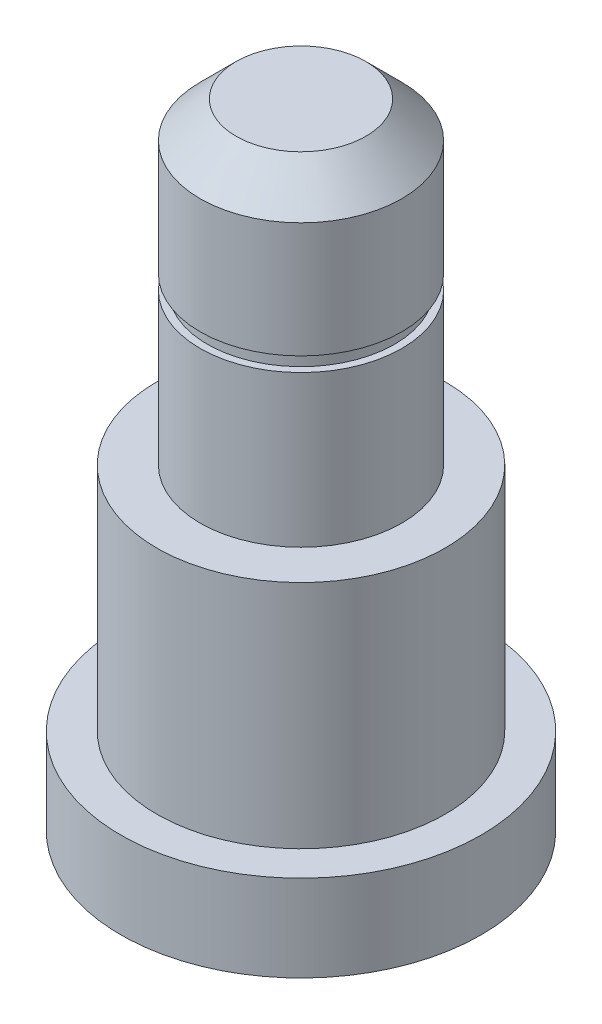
ISO-10303-21;
HEADER;
FILE_DESCRIPTION(('STEP AP214'),'2;1');
FILE_NAME('part.step','',(''),(''),'','','');
FILE_SCHEMA(('AUTOMOTIVE_DESIGN { 1 0 10303 214 1 1 1 1 }'));
ENDSEC;
DATA;
#1=APPLICATION_CONTEXT('core data for automotive mechanical design processes');
#2=APPLICATION_PROTOCOL_DEFINITION('international standard','automotive_design',2000,#1);
#3=PRODUCT_CONTEXT('',#1,'mechanical');
#4=PRODUCT('Part','Part','',(#3));
#5=PRODUCT_RELATED_PRODUCT_CATEGORY('part','',(#4));
#6=PRODUCT_DEFINITION_FORMATION('','',#4);
#7=PRODUCT_DEFINITION_CONTEXT('part definition',#1,'design');
#8=PRODUCT_DEFINITION('design','',#6,#7);
#9=PRODUCT_DEFINITION_SHAPE('','',#8);
#10=(LENGTH_UNIT() NAMED_UNIT(*) SI_UNIT(.MILLI.,.METRE.));
#11=(NAMED_UNIT(*) PLANE_ANGLE_UNIT() SI_UNIT($,.RADIAN.));
#12=(NAMED_UNIT(*) SI_UNIT($,.STERADIAN.) SOLID_ANGLE_UNIT());
#13=UNCERTAINTY_MEASURE_WITH_UNIT(LENGTH_MEASURE(1.E-05),#10,'distance_accuracy_value','');
#14=(GEOMETRIC_REPRESENTATION_CONTEXT(3) GLOBAL_UNCERTAINTY_ASSIGNED_CONTEXT((#13)) GLOBAL_UNIT_ASSIGNED_CONTEXT((#10,
#11,#12)) REPRESENTATION_CONTEXT('',''));
#15=CARTESIAN_POINT('',(0.,0.,0.));
#16=DIRECTION('',(0.,0.,1.));
#17=DIRECTION('',(1.,0.,0.));
#18=AXIS2_PLACEMENT_3D('',#15,#16,#17);
#19=CARTESIAN_POINT('',(0.,0.,0.));
#20=DIRECTION('',(0.,1.,0.));
#21=DIRECTION('',(-1.,0.,0.));
#22=AXIS2_PLACEMENT_3D('',#19,#20,#21);
#23=PLANE('',#22);
#24=CARTESIAN_POINT('',(0.,0.,0.));
#25=DIRECTION('',(0.,1.,0.));
#26=DIRECTION('',(-1.,0.,0.));
#27=AXIS2_PLACEMENT_3D('',#24,#25,#26);
#28=CIRCLE('',#27,12.5);
#29=CARTESIAN_POINT('',(-12.5,0.,0.));
#30=VERTEX_POINT('',#29);
#31=EDGE_CURVE('E10',#30,#30,#28,.T.);
#32=ORIENTED_EDGE('',*,*,#31,.F.);
#33=EDGE_LOOP('',(#32));
#34=FACE_BOUND('',#33,.T.);
#35=ADVANCED_FACE('F29',(#34),#23,.F.);
#36=CARTESIAN_POINT('',(0.,44.,0.));
#37=DIRECTION('',(0.,1.,0.));
#38=DIRECTION('',(-1.,0.,0.));
#39=AXIS2_PLACEMENT_3D('',#36,#37,#38);
#40=CYLINDRICAL_SURFACE('',#39,12.5);
#41=CARTESIAN_POINT('',(0.,6.,0.));
#42=DIRECTION('',(0.,1.,0.));
#43=DIRECTION('',(-1.,0.,0.));
#44=AXIS2_PLACEMENT_3D('',#41,#42,#43);
#45=CIRCLE('',#44,12.5);
#46=CARTESIAN_POINT('',(-12.5,6.,0.));
#47=VERTEX_POINT('',#46);
#48=EDGE_CURVE('E35',#47,#47,#45,.T.);
#49=ORIENTED_EDGE('',*,*,#48,.F.);
#50=EDGE_LOOP('',(#49));
#51=FACE_BOUND('',#50,.T.);
#52=ORIENTED_EDGE('',*,*,#31,.T.);
#53=EDGE_LOOP('',(#52));
#54=FACE_BOUND('',#53,.T.);
#55=ADVANCED_FACE('F122',(#51,#54),#40,.T.);
#56=CARTESIAN_POINT('',(12.5,6.,0.));
#57=DIRECTION('',(0.,-1.,0.));
#58=DIRECTION('',(1.,0.,0.));
#59=AXIS2_PLACEMENT_3D('',#56,#57,#58);
#60=PLANE('',#59);
#61=CARTESIAN_POINT('',(0.,6.,0.));
#62=DIRECTION('',(0.,1.,0.));
#63=DIRECTION('',(-1.,0.,0.));
#64=AXIS2_PLACEMENT_3D('',#61,#62,#63);
#65=CIRCLE('',#64,10.);
#66=CARTESIAN_POINT('',(-10.,6.,0.));
#67=VERTEX_POINT('',#66);
#68=EDGE_CURVE('E39',#67,#67,#65,.T.);
#69=ORIENTED_EDGE('',*,*,#68,.F.);
#70=EDGE_LOOP('',(#69));
#71=FACE_BOUND('',#70,.T.);
#72=ORIENTED_EDGE('',*,*,#48,.T.);
#73=EDGE_LOOP('',(#72));
#74=FACE_BOUND('',#73,.T.);
#75=ADVANCED_FACE('F117',(#71,#74),#60,.F.);
#76=CARTESIAN_POINT('',(0.,44.,0.));
#77=DIRECTION('',(0.,1.,0.));
#78=DIRECTION('',(-1.,0.,0.));
#79=AXIS2_PLACEMENT_3D('',#76,#77,#78);
#80=CYLINDRICAL_SURFACE('',#79,10.);
#81=CARTESIAN_POINT('',(0.,22.,0.));
#82=DIRECTION('',(0.,1.,0.));
#83=DIRECTION('',(-1.,0.,0.));
#84=AXIS2_PLACEMENT_3D('',#81,#82,#83);
#85=CIRCLE('',#84,10.);
#86=CARTESIAN_POINT('',(-10.,22.,0.));
#87=VERTEX_POINT('',#86);
#88=EDGE_CURVE('E43',#87,#87,#85,.T.);
#89=ORIENTED_EDGE('',*,*,#88,.F.);
#90=EDGE_LOOP('',(#89));
#91=FACE_BOUND('',#90,.T.);
#92=ORIENTED_EDGE('',*,*,#68,.T.);
#93=EDGE_LOOP('',(#92));
#94=FACE_BOUND('',#93,.T.);
#95=ADVANCED_FACE('F111',(#91,#94),#80,.T.);
#96=CARTESIAN_POINT('',(10.,22.,0.));
#97=DIRECTION('',(0.,-1.,0.));
#98=DIRECTION('',(1.,0.,0.));
#99=AXIS2_PLACEMENT_3D('',#96,#97,#98);
#100=PLANE('',#99);
#101=CARTESIAN_POINT('',(0.,22.,0.));
#102=DIRECTION('',(0.,1.,0.));
#103=DIRECTION('',(-1.,0.,0.));
#104=AXIS2_PLACEMENT_3D('',#101,#102,#103);
#105=CIRCLE('',#104,7.);
#106=CARTESIAN_POINT('',(-7.,22.,0.));
#107=VERTEX_POINT('',#106);
#108=EDGE_CURVE('E48',#107,#107,#105,.T.);
#109=ORIENTED_EDGE('',*,*,#108,.F.);
#110=EDGE_LOOP('',(#109));
#111=FACE_BOUND('',#110,.T.);
#112=ORIENTED_EDGE('',*,*,#88,.T.);
#113=EDGE_LOOP('',(#112));
#114=FACE_BOUND('',#113,.T.);
#115=ADVANCED_FACE('F105',(#111,#114),#100,.F.);
#116=CARTESIAN_POINT('',(0.,44.,0.));
#117=DIRECTION('',(0.,1.,0.));
#118=DIRECTION('',(-1.,0.,0.));
#119=AXIS2_PLACEMENT_3D('',#116,#117,#118);
#120=CYLINDRICAL_SURFACE('',#119,7.);
#121=CARTESIAN_POINT('',(0.,32.5,0.));
#122=DIRECTION('',(0.,1.,0.));
#123=DIRECTION('',(-1.,0.,0.));
#124=AXIS2_PLACEMENT_3D('',#121,#122,#123);
#125=CIRCLE('',#124,7.);
#126=CARTESIAN_POINT('',(-7.,32.5,0.));
#127=VERTEX_POINT('',#126);
#128=EDGE_CURVE('E51',#127,#127,#125,.T.);
#129=ORIENTED_EDGE('',*,*,#128,.F.);
#130=EDGE_LOOP('',(#129));
#131=FACE_BOUND('',#130,.T.);
#132=ORIENTED_EDGE('',*,*,#108,.T.);
#133=EDGE_LOOP('',(#132));
#134=FACE_BOUND('',#133,.T.);
#135=ADVANCED_FACE('F99',(#131,#134),#120,.T.);
#136=CARTESIAN_POINT('',(7.,32.5,0.));
#137=DIRECTION('',(0.,-1.,0.));
#138=DIRECTION('',(1.,0.,0.));
#139=AXIS2_PLACEMENT_3D('',#136,#137,#138);
#140=PLANE('',#139);
#141=CARTESIAN_POINT('',(0.,32.5,0.));
#142=DIRECTION('',(0.,1.,0.));
#143=DIRECTION('',(-1.,0.,0.));
#144=AXIS2_PLACEMENT_3D('',#141,#142,#143);
#145=CIRCLE('',#144,6.5);
#146=CARTESIAN_POINT('',(-6.5,32.5,0.));
#147=VERTEX_POINT('',#146);
#148=EDGE_CURVE('E54',#147,#147,#145,.T.);
#149=ORIENTED_EDGE('',*,*,#148,.F.);
#150=EDGE_LOOP('',(#149));
#151=FACE_BOUND('',#150,.T.);
#152=ORIENTED_EDGE('',*,*,#128,.T.);
#153=EDGE_LOOP('',(#152));
#154=FACE_BOUND('',#153,.T.);
#155=ADVANCED_FACE('F93',(#151,#154),#140,.F.);
#156=CARTESIAN_POINT('',(0.,44.,0.));
#157=DIRECTION('',(0.,1.,0.));
#158=DIRECTION('',(-1.,0.,0.));
#159=AXIS2_PLACEMENT_3D('',#156,#157,#158);
#160=CYLINDRICAL_SURFACE('',#159,6.5);
#161=CARTESIAN_POINT('',(0.,33.5,0.));
#162=DIRECTION('',(0.,1.,0.));
#163=DIRECTION('',(-1.,0.,0.));
#164=AXIS2_PLACEMENT_3D('',#161,#162,#163);
#165=CIRCLE('',#164,6.5);
#166=CARTESIAN_POINT('',(-6.5,33.5,0.));
#167=VERTEX_POINT('',#166);
#168=EDGE_CURVE('E57',#167,#167,#165,.T.);
#169=ORIENTED_EDGE('',*,*,#168,.F.);
#170=EDGE_LOOP('',(#169));
#171=FACE_BOUND('',#170,.T.);
#172=ORIENTED_EDGE('',*,*,#148,.T.);
#173=EDGE_LOOP('',(#172));
#174=FACE_BOUND('',#173,.T.);
#175=ADVANCED_FACE('F87',(#171,#174),#160,.T.);
#176=CARTESIAN_POINT('',(6.5,33.5,0.));
#177=DIRECTION('',(0.,1.,0.));
#178=DIRECTION('',(-1.,0.,0.));
#179=AXIS2_PLACEMENT_3D('',#176,#177,#178);
#180=PLANE('',#179);
#181=CARTESIAN_POINT('',(0.,33.5,0.));
#182=DIRECTION('',(0.,1.,0.));
#183=DIRECTION('',(-1.,0.,0.));
#184=AXIS2_PLACEMENT_3D('',#181,#182,#183);
#185=CIRCLE('',#184,7.);
#186=CARTESIAN_POINT('',(-7.,33.5,0.));
#187=VERTEX_POINT('',#186);
#188=EDGE_CURVE('E60',#187,#187,#185,.T.);
#189=ORIENTED_EDGE('',*,*,#188,.F.);
#190=EDGE_LOOP('',(#189));
#191=FACE_BOUND('',#190,.T.);
#192=ORIENTED_EDGE('',*,*,#168,.T.);
#193=EDGE_LOOP('',(#192));
#194=FACE_BOUND('',#193,.T.);
#195=ADVANCED_FACE('F81',(#191,#194),#180,.F.);
#196=CARTESIAN_POINT('',(0.,44.,0.));
#197=DIRECTION('',(0.,1.,0.));
#198=DIRECTION('',(-1.,0.,0.));
#199=AXIS2_PLACEMENT_3D('',#196,#197,#198);
#200=CYLINDRICAL_SURFACE('',#199,7.);
#201=CARTESIAN_POINT('',(0.,41.5,0.));
#202=DIRECTION('',(0.,1.,0.));
#203=DIRECTION('',(-1.,0.,0.));
#204=AXIS2_PLACEMENT_3D('',#201,#202,#203);
#205=CIRCLE('',#204,7.);
#206=CARTESIAN_POINT('',(-7.,41.5,0.));
#207=VERTEX_POINT('',#206);
#208=EDGE_CURVE('E63',#207,#207,#205,.T.);
#209=ORIENTED_EDGE('',*,*,#208,.F.);
#210=EDGE_LOOP('',(#209));
#211=FACE_BOUND('',#210,.T.);
#212=ORIENTED_EDGE('',*,*,#188,.T.);
#213=EDGE_LOOP('',(#212));
#214=FACE_BOUND('',#213,.T.);
#215=ADVANCED_FACE('F75',(#211,#214),#200,.T.);
#216=CARTESIAN_POINT('',(0.,41.5,0.));
#217=DIRECTION('',(0.,-1.,0.));
#218=DIRECTION('',(1.,0.,0.));
#219=AXIS2_PLACEMENT_3D('',#216,#217,#218);
#220=CONICAL_SURFACE('',#219,7.,0.785398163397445);
#221=CARTESIAN_POINT('',(0.,44.,0.));
#222=DIRECTION('',(0.,1.,0.));
#223=DIRECTION('',(-1.,0.,0.));
#224=AXIS2_PLACEMENT_3D('',#221,#222,#223);
#225=CIRCLE('',#224,4.5);
#226=CARTESIAN_POINT('',(-4.5,44.,0.));
#227=VERTEX_POINT('',#226);
#228=EDGE_CURVE('E66',#227,#227,#225,.T.);
#229=ORIENTED_EDGE('',*,*,#228,.F.);
#230=EDGE_LOOP('',(#229));
#231=FACE_BOUND('',#230,.T.);
#232=ORIENTED_EDGE('',*,*,#208,.T.);
#233=EDGE_LOOP('',(#232));
#234=FACE_BOUND('',#233,.T.);
#235=ADVANCED_FACE('F72',(#231,#234),#220,.T.);
#236=CARTESIAN_POINT('',(4.5,44.,0.));
#237=DIRECTION('',(0.,-1.,0.));
#238=DIRECTION('',(1.,0.,0.));
#239=AXIS2_PLACEMENT_3D('',#236,#237,#238);
#240=PLANE('',#239);
#241=ORIENTED_EDGE('',*,*,#228,.T.);
#242=EDGE_LOOP('',(#241));
#243=FACE_BOUND('',#242,.T.);
#244=ADVANCED_FACE('F70',(#243),#240,.F.);
#245=CLOSED_SHELL('',(#35,#55,#75,#95,#115,#135,#155,#175,#195,#215,#235,#244));
#246=MANIFOLD_SOLID_BREP('B2',#245);
#247=ADVANCED_BREP_SHAPE_REPRESENTATION('',(#18,#246),#14);
#248=SHAPE_DEFINITION_REPRESENTATION(#9,#247);
ENDSEC;
END-ISO-10303-21;
